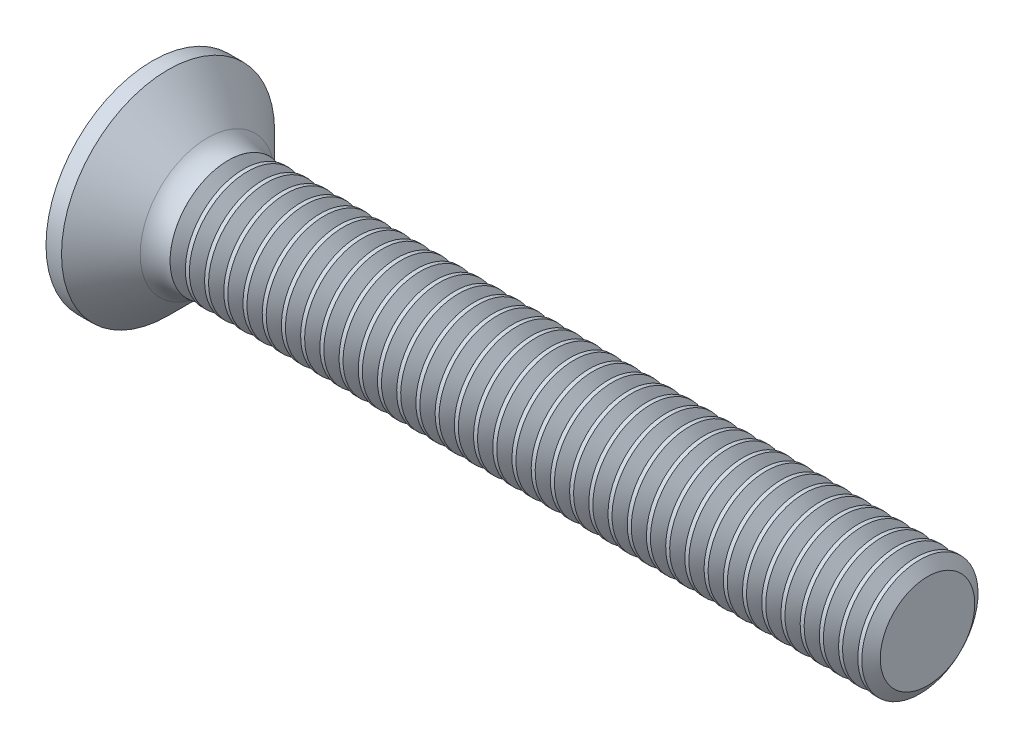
from build123d import *

# Parameters (mm, degrees)
FILLET1_R       = 0.8
RECPAT_COUNT    = 2
RECPAT_ANGLE    = 90
THDSCHPAT_COUNT = 37
THDSCHPAT_PITCH = 0.495833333


with BuildPart() as part:
    # BodySke → Base-Revolve (revolve)
    with BuildSketch(Plane.XY, mode=Mode.PRIVATE) as base_revolve_sk:
        Polygon((0, 0), (0, 2.75), (0.4, 2.75), (1.65, 1.5), (20, 1.5), (20, 0), align=None)
    revolve(base_revolve_sk.sketch.rotate(Axis((-6.35, 0, 0), (1, 0, 0)), 90), axis=Axis((-6.35, 0, 0), (1, 0, 0)))

    # Fillet1
    fillet1_edges = [part.edges().sort_by_distance(p)[0] for p in [
        (1.65, 0, -1.5),
    ]]
    fillet(fillet1_edges, radius=FILLET1_R)

    # Sketch3 → Recess section 0
    with BuildSketch(Plane.ZY):
        with BuildLine():
            Line((-0.37, 1.5), (0.37, 1.5))
            Line((0.37, 1.5), (0.37, -1.5))
            Line((0.37, -1.5), (-0.37, -1.5))
            Line((-0.37, -1.5), (-0.37, 1.5))
        make_face()
    # Sketch4 → Recess section 1
    with BuildSketch(Plane.ZY.offset(-2.01)):
        with BuildLine():
            Line((-0.37, 0.497851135), (0.37, 0.497851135))
            Line((0.37, 0.497851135), (0.37, -0.497851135))
            Line((0.37, -0.497851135), (-0.37, -0.497851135))
            Line((-0.37, -0.497851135), (-0.37, 0.497851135))
        make_face()
    recess = loft(mode=Mode.SUBTRACT)

    # RecPat: Recess ×2 about axis
    recpat_axis = Axis((0, 0, 0), (1, 0, 0))
    for i in range(1, RECPAT_COUNT):
        add(recess.rotate(recpat_axis, i * RECPAT_ANGLE / (RECPAT_COUNT - 1)), mode=Mode.SUBTRACT)

    # RecCorSke → RecessCore (revolve, cut)
    with BuildSketch(Plane.XY, mode=Mode.PRIVATE) as recesscore_sk:
        Polygon((0, 0), (0, 0.696552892), (2.01, 0.556), (2.190655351, 0), align=None)
    revolve(recesscore_sk.sketch.rotate(Axis((-3.175, 0, 0), (1, 0, 0)), 90), axis=Axis((-3.175, 0, 0), (1, 0, 0)), mode=Mode.SUBTRACT)

    # ThdSchSke → ThreadSchematic (revolve, cut)
    with BuildSketch(Plane.XY, mode=Mode.PRIVATE) as threadschematic_sk:
        Polygon((2.150001, -1.2195), (1.953592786, -1.5), (1.953592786, -1.875), (2.346409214, -1.875), (2.346409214, -1.5), align=None)
    threadschematic = revolve(threadschematic_sk.sketch.rotate(Axis((-3.175, 0, 0), (1, 0, 0)), 270), axis=Axis((-3.175, 0, 0), (1, 0, 0)), mode=Mode.SUBTRACT)

    # ThdSchPat: ThreadSchematic ×37
    with Locations(*[(i * THDSCHPAT_PITCH, 0, 0) for i in range(1, THDSCHPAT_COUNT)]):
        add(threadschematic, mode=Mode.SUBTRACT)


solid = part.part
